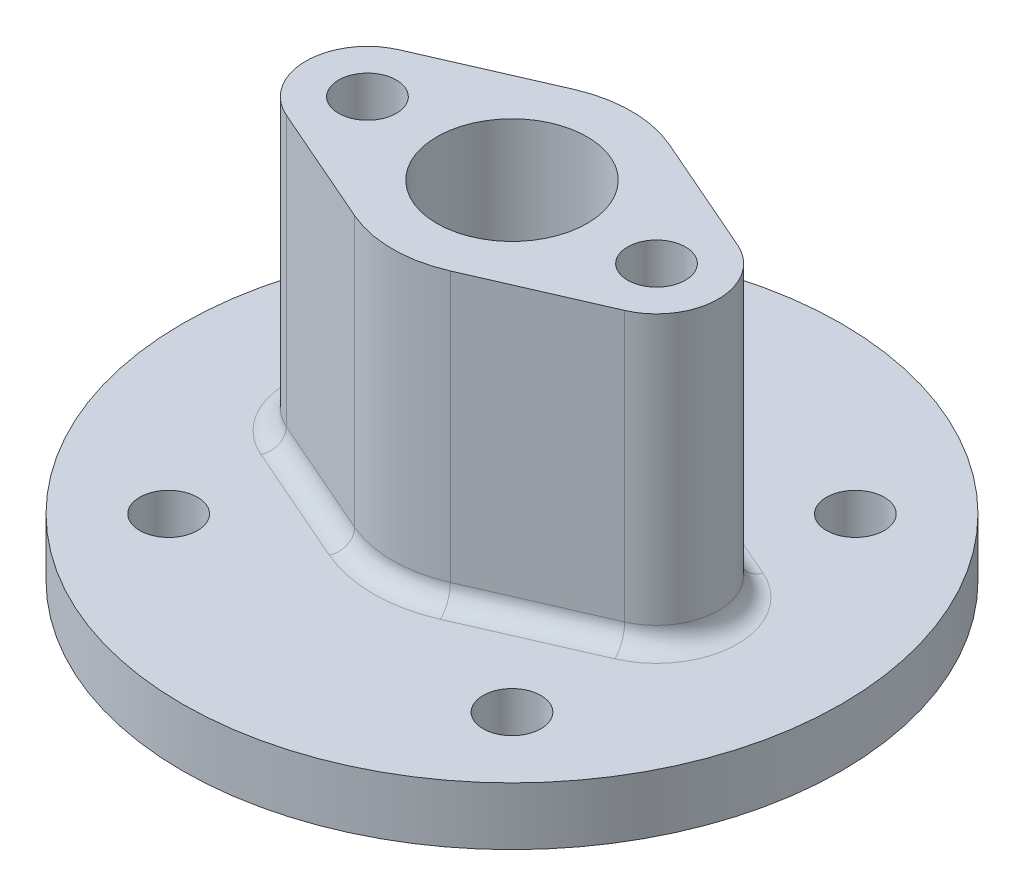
ISO-10303-21;
HEADER;
FILE_DESCRIPTION(('STEP AP214'),'2;1');
FILE_NAME('part.step','',(''),(''),'','','');
FILE_SCHEMA(('AUTOMOTIVE_DESIGN { 1 0 10303 214 1 1 1 1 }'));
ENDSEC;
DATA;
#1=APPLICATION_CONTEXT('core data for automotive mechanical design processes');
#2=APPLICATION_PROTOCOL_DEFINITION('international standard','automotive_design',2000,#1);
#3=PRODUCT_CONTEXT('',#1,'mechanical');
#4=PRODUCT('Part','Part','',(#3));
#5=PRODUCT_RELATED_PRODUCT_CATEGORY('part','',(#4));
#6=PRODUCT_DEFINITION_FORMATION('','',#4);
#7=PRODUCT_DEFINITION_CONTEXT('part definition',#1,'design');
#8=PRODUCT_DEFINITION('design','',#6,#7);
#9=PRODUCT_DEFINITION_SHAPE('','',#8);
#10=(LENGTH_UNIT() NAMED_UNIT(*) SI_UNIT(.MILLI.,.METRE.));
#11=(NAMED_UNIT(*) PLANE_ANGLE_UNIT() SI_UNIT($,.RADIAN.));
#12=(NAMED_UNIT(*) SI_UNIT($,.STERADIAN.) SOLID_ANGLE_UNIT());
#13=UNCERTAINTY_MEASURE_WITH_UNIT(LENGTH_MEASURE(1.E-05),#10,'distance_accuracy_value','');
#14=(GEOMETRIC_REPRESENTATION_CONTEXT(3) GLOBAL_UNCERTAINTY_ASSIGNED_CONTEXT((#13)) GLOBAL_UNIT_ASSIGNED_CONTEXT((#10,
#11,#12)) REPRESENTATION_CONTEXT('',''));
#15=CARTESIAN_POINT('',(0.,0.,0.));
#16=DIRECTION('',(0.,0.,1.));
#17=DIRECTION('',(1.,0.,0.));
#18=AXIS2_PLACEMENT_3D('',#15,#16,#17);
#19=CARTESIAN_POINT('',(0.,0.,0.));
#20=DIRECTION('',(0.,-1.,0.));
#21=DIRECTION('',(0.,0.,-1.));
#22=AXIS2_PLACEMENT_3D('',#19,#20,#21);
#23=PLANE('',#22);
#24=CARTESIAN_POINT('',(0.,0.,0.));
#25=DIRECTION('',(0.,-1.,0.));
#26=DIRECTION('',(0.,0.,-1.));
#27=AXIS2_PLACEMENT_3D('',#24,#25,#26);
#28=CIRCLE('',#27,24.);
#29=CARTESIAN_POINT('',(0.,0.,-24.));
#30=VERTEX_POINT('',#29);
#31=EDGE_CURVE('E224',#30,#30,#28,.T.);
#32=ORIENTED_EDGE('',*,*,#31,.T.);
#33=EDGE_LOOP('',(#32));
#34=FACE_BOUND('',#33,.T.);
#35=CARTESIAN_POINT('',(0.,0.,0.));
#36=DIRECTION('',(0.,1.,0.));
#37=DIRECTION('',(0.,0.,1.));
#38=AXIS2_PLACEMENT_3D('',#35,#36,#37);
#39=CIRCLE('',#38,10.5);
#40=CARTESIAN_POINT('',(0.,0.,10.5));
#41=VERTEX_POINT('',#40);
#42=EDGE_CURVE('E152',#41,#41,#39,.T.);
#43=ORIENTED_EDGE('',*,*,#42,.T.);
#44=EDGE_LOOP('',(#43));
#45=FACE_BOUND('',#44,.T.);
#46=ADVANCED_FACE('F33',(#34,#45),#23,.T.);
#47=CARTESIAN_POINT('',(-37.5,132.,0.));
#48=DIRECTION('',(0.,1.,0.));
#49=DIRECTION('',(0.,0.,1.));
#50=AXIS2_PLACEMENT_3D('',#47,#48,#49);
#51=PLANE('',#50);
#52=CARTESIAN_POINT('',(-37.5,132.,0.));
#53=DIRECTION('',(0.,1.,0.));
#54=DIRECTION('',(0.,0.,1.));
#55=AXIS2_PLACEMENT_3D('',#52,#53,#54);
#56=CIRCLE('',#55,7.5);
#57=CARTESIAN_POINT('',(-37.5,132.,7.5));
#58=VERTEX_POINT('',#57);
#59=EDGE_CURVE('E139',#58,#58,#56,.T.);
#60=ORIENTED_EDGE('',*,*,#59,.F.);
#61=EDGE_LOOP('',(#60));
#62=FACE_BOUND('',#61,.T.);
#63=CARTESIAN_POINT('',(37.5,132.,0.));
#64=DIRECTION('',(0.,1.,0.));
#65=DIRECTION('',(0.,0.,1.));
#66=AXIS2_PLACEMENT_3D('',#63,#64,#65);
#67=CIRCLE('',#66,7.5);
#68=CARTESIAN_POINT('',(37.5,132.,7.5));
#69=VERTEX_POINT('',#68);
#70=EDGE_CURVE('E138',#69,#69,#67,.T.);
#71=ORIENTED_EDGE('',*,*,#70,.F.);
#72=EDGE_LOOP('',(#71));
#73=FACE_BOUND('',#72,.T.);
#74=CARTESIAN_POINT('',(-37.5,132.,0.));
#75=DIRECTION('',(0.,1.,0.));
#76=DIRECTION('',(0.,0.,1.));
#77=AXIS2_PLACEMENT_3D('',#74,#75,#76);
#78=CIRCLE('',#77,16.);
#79=CARTESIAN_POINT('',(-43.9,132.,-14.6642422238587));
#80=VERTEX_POINT('',#79);
#81=CARTESIAN_POINT('',(-43.9,132.,14.6642422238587));
#82=VERTEX_POINT('',#81);
#83=EDGE_CURVE('E177',#80,#82,#78,.T.);
#84=ORIENTED_EDGE('',*,*,#83,.T.);
#85=DIRECTION('',(0.916515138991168,0.,0.4));
#86=VECTOR('',#85,1.);
#87=CARTESIAN_POINT('',(-43.9,132.,14.6642422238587));
#88=LINE('',#87,#86);
#89=CARTESIAN_POINT('',(-12.4,132.,28.4119693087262));
#90=VERTEX_POINT('',#89);
#91=EDGE_CURVE('E180',#82,#90,#88,.T.);
#92=ORIENTED_EDGE('',*,*,#91,.T.);
#93=CARTESIAN_POINT('',(0.,132.,0.));
#94=DIRECTION('',(0.,1.,0.));
#95=DIRECTION('',(0.,0.,1.));
#96=AXIS2_PLACEMENT_3D('',#93,#94,#95);
#97=CIRCLE('',#96,31.);
#98=CARTESIAN_POINT('',(12.4,132.,28.4119693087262));
#99=VERTEX_POINT('',#98);
#100=EDGE_CURVE('E182',#90,#99,#97,.T.);
#101=ORIENTED_EDGE('',*,*,#100,.T.);
#102=DIRECTION('',(0.916515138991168,0.,-0.4));
#103=VECTOR('',#102,1.);
#104=CARTESIAN_POINT('',(43.9,132.,14.6642422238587));
#105=LINE('',#104,#103);
#106=CARTESIAN_POINT('',(43.9,132.,14.6642422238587));
#107=VERTEX_POINT('',#106);
#108=EDGE_CURVE('E184',#99,#107,#105,.T.);
#109=ORIENTED_EDGE('',*,*,#108,.T.);
#110=CARTESIAN_POINT('',(37.5,132.,0.));
#111=DIRECTION('',(0.,1.,0.));
#112=DIRECTION('',(0.,0.,1.));
#113=AXIS2_PLACEMENT_3D('',#110,#111,#112);
#114=CIRCLE('',#113,16.);
#115=CARTESIAN_POINT('',(43.9,132.,-14.6642422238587));
#116=VERTEX_POINT('',#115);
#117=EDGE_CURVE('E186',#107,#116,#114,.T.);
#118=ORIENTED_EDGE('',*,*,#117,.T.);
#119=DIRECTION('',(-0.916515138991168,0.,-0.4));
#120=VECTOR('',#119,1.);
#121=CARTESIAN_POINT('',(43.9,132.,-14.6642422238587));
#122=LINE('',#121,#120);
#123=CARTESIAN_POINT('',(12.4,132.,-28.4119693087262));
#124=VERTEX_POINT('',#123);
#125=EDGE_CURVE('E188',#116,#124,#122,.T.);
#126=ORIENTED_EDGE('',*,*,#125,.T.);
#127=CARTESIAN_POINT('',(0.,132.,0.));
#128=DIRECTION('',(0.,1.,0.));
#129=DIRECTION('',(0.,0.,1.));
#130=AXIS2_PLACEMENT_3D('',#127,#128,#129);
#131=CIRCLE('',#130,31.);
#132=CARTESIAN_POINT('',(-12.4,132.,-28.4119693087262));
#133=VERTEX_POINT('',#132);
#134=EDGE_CURVE('E190',#124,#133,#131,.T.);
#135=ORIENTED_EDGE('',*,*,#134,.T.);
#136=DIRECTION('',(-0.916515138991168,0.,0.4));
#137=VECTOR('',#136,1.);
#138=CARTESIAN_POINT('',(-43.9,132.,-14.6642422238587));
#139=LINE('',#138,#137);
#140=EDGE_CURVE('E192',#133,#80,#139,.T.);
#141=ORIENTED_EDGE('',*,*,#140,.T.);
#142=EDGE_LOOP('',(#84,#92,#101,#109,#118,#126,#135,#141));
#143=FACE_BOUND('',#142,.T.);
#144=CARTESIAN_POINT('',(0.,132.,0.));
#145=DIRECTION('',(0.,1.,0.));
#146=DIRECTION('',(0.,0.,1.));
#147=AXIS2_PLACEMENT_3D('',#144,#145,#146);
#148=CIRCLE('',#147,19.5);
#149=CARTESIAN_POINT('',(0.,132.,19.5));
#150=VERTEX_POINT('',#149);
#151=EDGE_CURVE('E174',#150,#150,#148,.T.);
#152=ORIENTED_EDGE('',*,*,#151,.F.);
#153=EDGE_LOOP('',(#152));
#154=FACE_BOUND('',#153,.T.);
#155=ADVANCED_FACE('F307',(#62,#73,#143,#154),#51,.T.);
#156=CARTESIAN_POINT('',(85.5,57.,0.));
#157=DIRECTION('',(0.,1.,0.));
#158=DIRECTION('',(0.,0.,1.));
#159=AXIS2_PLACEMENT_3D('',#156,#157,#158);
#160=PLANE('',#159);
#161=CARTESIAN_POINT('',(-44.5477272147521,57.,-44.5477272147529));
#162=DIRECTION('',(0.,1.,0.));
#163=DIRECTION('',(1.,0.,0.));
#164=AXIS2_PLACEMENT_3D('',#161,#162,#163);
#165=CIRCLE('',#164,7.5);
#166=CARTESIAN_POINT('',(-37.0477272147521,57.,-44.5477272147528));
#167=VERTEX_POINT('',#166);
#168=EDGE_CURVE('E296',#167,#167,#165,.T.);
#169=ORIENTED_EDGE('',*,*,#168,.F.);
#170=EDGE_LOOP('',(#169));
#171=FACE_BOUND('',#170,.T.);
#172=CARTESIAN_POINT('',(-44.5477272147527,57.,44.5477272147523));
#173=DIRECTION('',(0.,1.,0.));
#174=DIRECTION('',(0.,0.,-1.));
#175=AXIS2_PLACEMENT_3D('',#172,#173,#174);
#176=CIRCLE('',#175,7.5);
#177=CARTESIAN_POINT('',(-44.5477272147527,57.,37.0477272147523));
#178=VERTEX_POINT('',#177);
#179=EDGE_CURVE('E286',#178,#178,#176,.T.);
#180=ORIENTED_EDGE('',*,*,#179,.F.);
#181=EDGE_LOOP('',(#180));
#182=FACE_BOUND('',#181,.T.);
#183=CARTESIAN_POINT('',(44.5477272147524,57.,44.5477272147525));
#184=DIRECTION('',(0.,1.,0.));
#185=DIRECTION('',(-1.,0.,0.));
#186=AXIS2_PLACEMENT_3D('',#183,#184,#185);
#187=CIRCLE('',#186,7.5);
#188=CARTESIAN_POINT('',(37.0477272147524,57.,44.5477272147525));
#189=VERTEX_POINT('',#188);
#190=EDGE_CURVE('E283',#189,#189,#187,.T.);
#191=ORIENTED_EDGE('',*,*,#190,.F.);
#192=EDGE_LOOP('',(#191));
#193=FACE_BOUND('',#192,.T.);
#194=CARTESIAN_POINT('',(44.5477272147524,57.,-44.5477272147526));
#195=DIRECTION('',(0.,1.,0.));
#196=DIRECTION('',(0.,0.,1.));
#197=AXIS2_PLACEMENT_3D('',#194,#195,#196);
#198=CIRCLE('',#197,7.5);
#199=CARTESIAN_POINT('',(44.5477272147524,57.,-37.0477272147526));
#200=VERTEX_POINT('',#199);
#201=EDGE_CURVE('E280',#200,#200,#198,.T.);
#202=ORIENTED_EDGE('',*,*,#201,.F.);
#203=EDGE_LOOP('',(#202));
#204=FACE_BOUND('',#203,.T.);
#205=DIRECTION('',(0.916515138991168,0.,-0.4));
#206=VECTOR('',#205,1.);
#207=CARTESIAN_POINT('',(86.22,57.,1.6497272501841));
#208=LINE('',#207,#206);
#209=CARTESIAN_POINT('',(45.9,57.,19.2468179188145));
#210=VERTEX_POINT('',#209);
#211=CARTESIAN_POINT('',(14.4,57.,32.9945450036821));
#212=VERTEX_POINT('',#211);
#213=EDGE_CURVE('E230',#210,#212,#208,.F.);
#214=ORIENTED_EDGE('',*,*,#213,.T.);
#215=CARTESIAN_POINT('',(0.,57.,0.));
#216=DIRECTION('',(0.,1.,0.));
#217=DIRECTION('',(0.,0.,1.));
#218=AXIS2_PLACEMENT_3D('',#215,#216,#217);
#219=CIRCLE('',#218,36.);
#220=CARTESIAN_POINT('',(-14.4,57.,32.994545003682));
#221=VERTEX_POINT('',#220);
#222=EDGE_CURVE('E244',#212,#221,#219,.F.);
#223=ORIENTED_EDGE('',*,*,#222,.T.);
#224=DIRECTION('',(0.916515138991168,0.,0.4));
#225=VECTOR('',#224,1.);
#226=CARTESIAN_POINT('',(57.42,57.,64.33936275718));
#227=LINE('',#226,#225);
#228=CARTESIAN_POINT('',(-45.9,57.,19.2468179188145));
#229=VERTEX_POINT('',#228);
#230=EDGE_CURVE('E242',#221,#229,#227,.F.);
#231=ORIENTED_EDGE('',*,*,#230,.T.);
#232=CARTESIAN_POINT('',(-37.5,57.,0.));
#233=DIRECTION('',(0.,1.,0.));
#234=DIRECTION('',(0.,0.,1.));
#235=AXIS2_PLACEMENT_3D('',#232,#233,#234);
#236=CIRCLE('',#235,21.);
#237=CARTESIAN_POINT('',(-45.9,57.,-19.2468179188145));
#238=VERTEX_POINT('',#237);
#239=EDGE_CURVE('E240',#229,#238,#236,.F.);
#240=ORIENTED_EDGE('',*,*,#239,.T.);
#241=DIRECTION('',(-0.916515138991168,0.,0.4));
#242=VECTOR('',#241,1.);
#243=CARTESIAN_POINT('',(57.42,57.,-64.33936275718));
#244=LINE('',#243,#242);
#245=CARTESIAN_POINT('',(-14.4,57.,-32.9945450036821));
#246=VERTEX_POINT('',#245);
#247=EDGE_CURVE('E238',#238,#246,#244,.F.);
#248=ORIENTED_EDGE('',*,*,#247,.T.);
#249=CARTESIAN_POINT('',(0.,57.,0.));
#250=DIRECTION('',(0.,1.,0.));
#251=DIRECTION('',(0.,0.,1.));
#252=AXIS2_PLACEMENT_3D('',#249,#250,#251);
#253=CIRCLE('',#252,36.);
#254=CARTESIAN_POINT('',(14.4,57.,-32.994545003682));
#255=VERTEX_POINT('',#254);
#256=EDGE_CURVE('E236',#246,#255,#253,.F.);
#257=ORIENTED_EDGE('',*,*,#256,.T.);
#258=DIRECTION('',(-0.916515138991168,0.,-0.4));
#259=VECTOR('',#258,1.);
#260=CARTESIAN_POINT('',(86.22,57.,-1.64972725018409));
#261=LINE('',#260,#259);
#262=CARTESIAN_POINT('',(45.9,57.,-19.2468179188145));
#263=VERTEX_POINT('',#262);
#264=EDGE_CURVE('E234',#255,#263,#261,.F.);
#265=ORIENTED_EDGE('',*,*,#264,.T.);
#266=CARTESIAN_POINT('',(37.5,57.,0.));
#267=DIRECTION('',(0.,1.,0.));
#268=DIRECTION('',(0.,0.,1.));
#269=AXIS2_PLACEMENT_3D('',#266,#267,#268);
#270=CIRCLE('',#269,21.);
#271=EDGE_CURVE('E232',#263,#210,#270,.F.);
#272=ORIENTED_EDGE('',*,*,#271,.T.);
#273=EDGE_LOOP('',(#214,#223,#231,#240,#248,#257,#265,#272));
#274=FACE_BOUND('',#273,.T.);
#275=CARTESIAN_POINT('',(0.,57.,0.));
#276=DIRECTION('',(0.,-1.,0.));
#277=DIRECTION('',(0.,0.,-1.));
#278=AXIS2_PLACEMENT_3D('',#275,#276,#277);
#279=CIRCLE('',#278,85.5);
#280=CARTESIAN_POINT('',(0.,57.,-85.5));
#281=VERTEX_POINT('',#280);
#282=EDGE_CURVE('E215',#281,#281,#279,.T.);
#283=ORIENTED_EDGE('',*,*,#282,.F.);
#284=EDGE_LOOP('',(#283));
#285=FACE_BOUND('',#284,.T.);
#286=ADVANCED_FACE('F303',(#171,#182,#193,#204,#274,#285),#160,.T.);
#287=CARTESIAN_POINT('',(0.,0.,0.));
#288=DIRECTION('',(0.,1.,0.));
#289=DIRECTION('',(0.,0.,1.));
#290=AXIS2_PLACEMENT_3D('',#287,#288,#289);
#291=CONICAL_SURFACE('',#290,24.,0.404891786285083);
#292=CARTESIAN_POINT('',(0.,42.,0.));
#293=DIRECTION('',(0.,-1.,0.));
#294=DIRECTION('',(0.,0.,-1.));
#295=AXIS2_PLACEMENT_3D('',#292,#293,#294);
#296=CIRCLE('',#295,42.);
#297=CARTESIAN_POINT('',(0.,42.,-42.));
#298=VERTEX_POINT('',#297);
#299=EDGE_CURVE('E221',#298,#298,#296,.T.);
#300=ORIENTED_EDGE('',*,*,#299,.T.);
#301=EDGE_LOOP('',(#300));
#302=FACE_BOUND('',#301,.T.);
#303=ORIENTED_EDGE('',*,*,#31,.F.);
#304=EDGE_LOOP('',(#303));
#305=FACE_BOUND('',#304,.T.);
#306=ADVANCED_FACE('F306',(#302,#305),#291,.T.);
#307=CARTESIAN_POINT('',(42.,42.,0.));
#308=DIRECTION('',(0.,-1.,0.));
#309=DIRECTION('',(0.,0.,-1.));
#310=AXIS2_PLACEMENT_3D('',#307,#308,#309);
#311=PLANE('',#310);
#312=CARTESIAN_POINT('',(-44.5477272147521,42.,-44.5477272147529));
#313=DIRECTION('',(0.,-1.,0.));
#314=DIRECTION('',(0.,0.,-1.));
#315=AXIS2_PLACEMENT_3D('',#312,#313,#314);
#316=CIRCLE('',#315,7.5);
#317=CARTESIAN_POINT('',(-44.5477272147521,42.,-52.0477272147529));
#318=VERTEX_POINT('',#317);
#319=EDGE_CURVE('E37',#318,#318,#316,.T.);
#320=ORIENTED_EDGE('',*,*,#319,.F.);
#321=EDGE_LOOP('',(#320));
#322=FACE_BOUND('',#321,.T.);
#323=CARTESIAN_POINT('',(-44.5477272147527,42.,44.5477272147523));
#324=DIRECTION('',(0.,-1.,0.));
#325=DIRECTION('',(0.,0.,-1.));
#326=AXIS2_PLACEMENT_3D('',#323,#324,#325);
#327=CIRCLE('',#326,7.5);
#328=CARTESIAN_POINT('',(-44.5477272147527,42.,37.0477272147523));
#329=VERTEX_POINT('',#328);
#330=EDGE_CURVE('E284',#329,#329,#327,.T.);
#331=ORIENTED_EDGE('',*,*,#330,.F.);
#332=EDGE_LOOP('',(#331));
#333=FACE_BOUND('',#332,.T.);
#334=CARTESIAN_POINT('',(44.5477272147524,42.,44.5477272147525));
#335=DIRECTION('',(0.,-1.,0.));
#336=DIRECTION('',(0.,0.,-1.));
#337=AXIS2_PLACEMENT_3D('',#334,#335,#336);
#338=CIRCLE('',#337,7.5);
#339=CARTESIAN_POINT('',(44.5477272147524,42.,37.0477272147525));
#340=VERTEX_POINT('',#339);
#341=EDGE_CURVE('E281',#340,#340,#338,.T.);
#342=ORIENTED_EDGE('',*,*,#341,.F.);
#343=EDGE_LOOP('',(#342));
#344=FACE_BOUND('',#343,.T.);
#345=CARTESIAN_POINT('',(44.5477272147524,42.,-44.5477272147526));
#346=DIRECTION('',(0.,-1.,0.));
#347=DIRECTION('',(0.,0.,-1.));
#348=AXIS2_PLACEMENT_3D('',#345,#346,#347);
#349=CIRCLE('',#348,7.5);
#350=CARTESIAN_POINT('',(44.5477272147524,42.,-52.0477272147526));
#351=VERTEX_POINT('',#350);
#352=EDGE_CURVE('E145',#351,#351,#349,.T.);
#353=ORIENTED_EDGE('',*,*,#352,.F.);
#354=EDGE_LOOP('',(#353));
#355=FACE_BOUND('',#354,.T.);
#356=CARTESIAN_POINT('',(0.,42.,0.));
#357=DIRECTION('',(0.,-1.,0.));
#358=DIRECTION('',(0.,0.,-1.));
#359=AXIS2_PLACEMENT_3D('',#356,#357,#358);
#360=CIRCLE('',#359,85.5);
#361=CARTESIAN_POINT('',(0.,42.,-85.5));
#362=VERTEX_POINT('',#361);
#363=EDGE_CURVE('E218',#362,#362,#360,.T.);
#364=ORIENTED_EDGE('',*,*,#363,.T.);
#365=EDGE_LOOP('',(#364));
#366=FACE_BOUND('',#365,.T.);
#367=ORIENTED_EDGE('',*,*,#299,.F.);
#368=EDGE_LOOP('',(#367));
#369=FACE_BOUND('',#368,.T.);
#370=ADVANCED_FACE('F319',(#322,#333,#344,#355,#366,#369),#311,.T.);
#371=CARTESIAN_POINT('',(0.,0.,0.));
#372=DIRECTION('',(0.,-1.,0.));
#373=DIRECTION('',(0.,0.,-1.));
#374=AXIS2_PLACEMENT_3D('',#371,#372,#373);
#375=CYLINDRICAL_SURFACE('',#374,85.5);
#376=ORIENTED_EDGE('',*,*,#282,.T.);
#377=EDGE_LOOP('',(#376));
#378=FACE_BOUND('',#377,.T.);
#379=ORIENTED_EDGE('',*,*,#363,.F.);
#380=EDGE_LOOP('',(#379));
#381=FACE_BOUND('',#380,.T.);
#382=ADVANCED_FACE('F315',(#378,#381),#375,.T.);
#383=CARTESIAN_POINT('',(-37.5,132.,0.));
#384=DIRECTION('',(0.,-1.,0.));
#385=DIRECTION('',(0.,0.,-1.));
#386=AXIS2_PLACEMENT_3D('',#383,#384,#385);
#387=CYLINDRICAL_SURFACE('',#386,16.);
#388=DIRECTION('',(0.,-1.,0.));
#389=VECTOR('',#388,1.);
#390=CARTESIAN_POINT('',(-43.9,132.,-14.6642422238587));
#391=LINE('',#390,#389);
#392=CARTESIAN_POINT('',(-43.9,62.,-14.6642422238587));
#393=VERTEX_POINT('',#392);
#394=EDGE_CURVE('E194',#80,#393,#391,.T.);
#395=ORIENTED_EDGE('',*,*,#394,.T.);
#396=CARTESIAN_POINT('',(-37.5,62.,0.));
#397=DIRECTION('',(0.,1.,0.));
#398=DIRECTION('',(0.,0.,1.));
#399=AXIS2_PLACEMENT_3D('',#396,#397,#398);
#400=CIRCLE('',#399,16.);
#401=CARTESIAN_POINT('',(-43.9,62.,14.6642422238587));
#402=VERTEX_POINT('',#401);
#403=EDGE_CURVE('E249',#393,#402,#400,.T.);
#404=ORIENTED_EDGE('',*,*,#403,.T.);
#405=DIRECTION('',(0.,-1.,0.));
#406=VECTOR('',#405,1.);
#407=CARTESIAN_POINT('',(-43.9,132.,14.6642422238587));
#408=LINE('',#407,#406);
#409=EDGE_CURVE('E212',#82,#402,#408,.T.);
#410=ORIENTED_EDGE('',*,*,#409,.F.);
#411=ORIENTED_EDGE('',*,*,#83,.F.);
#412=EDGE_LOOP('',(#395,#404,#410,#411));
#413=FACE_BOUND('',#412,.T.);
#414=ADVANCED_FACE('F318',(#413),#387,.T.);
#415=CARTESIAN_POINT('',(-43.9,132.,14.6642422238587));
#416=DIRECTION('',(0.4,0.,-0.916515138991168));
#417=DIRECTION('',(-0.916515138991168,0.,-0.4));
#418=AXIS2_PLACEMENT_3D('',#415,#416,#417);
#419=PLANE('',#418);
#420=ORIENTED_EDGE('',*,*,#409,.T.);
#421=DIRECTION('',(0.916515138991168,0.,0.4));
#422=VECTOR('',#421,1.);
#423=CARTESIAN_POINT('',(-43.9,62.,14.6642422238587));
#424=LINE('',#423,#422);
#425=CARTESIAN_POINT('',(-12.4,62.,28.4119693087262));
#426=VERTEX_POINT('',#425);
#427=EDGE_CURVE('E247',#402,#426,#424,.T.);
#428=ORIENTED_EDGE('',*,*,#427,.T.);
#429=DIRECTION('',(0.,-1.,0.));
#430=VECTOR('',#429,1.);
#431=CARTESIAN_POINT('',(-12.4,132.,28.4119693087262));
#432=LINE('',#431,#430);
#433=EDGE_CURVE('E209',#90,#426,#432,.T.);
#434=ORIENTED_EDGE('',*,*,#433,.F.);
#435=ORIENTED_EDGE('',*,*,#91,.F.);
#436=EDGE_LOOP('',(#420,#428,#434,#435));
#437=FACE_BOUND('',#436,.T.);
#438=ADVANCED_FACE('F400',(#437),#419,.F.);
#439=CARTESIAN_POINT('',(0.,132.,0.));
#440=DIRECTION('',(0.,-1.,0.));
#441=DIRECTION('',(0.,0.,-1.));
#442=AXIS2_PLACEMENT_3D('',#439,#440,#441);
#443=CYLINDRICAL_SURFACE('',#442,31.);
#444=ORIENTED_EDGE('',*,*,#433,.T.);
#445=CARTESIAN_POINT('',(0.,62.,0.));
#446=DIRECTION('',(0.,1.,0.));
#447=DIRECTION('',(0.,0.,1.));
#448=AXIS2_PLACEMENT_3D('',#445,#446,#447);
#449=CIRCLE('',#448,31.);
#450=CARTESIAN_POINT('',(12.4,62.,28.4119693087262));
#451=VERTEX_POINT('',#450);
#452=EDGE_CURVE('E227',#426,#451,#449,.T.);
#453=ORIENTED_EDGE('',*,*,#452,.T.);
#454=DIRECTION('',(0.,-1.,0.));
#455=VECTOR('',#454,1.);
#456=CARTESIAN_POINT('',(12.4,132.,28.4119693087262));
#457=LINE('',#456,#455);
#458=EDGE_CURVE('E207',#99,#451,#457,.T.);
#459=ORIENTED_EDGE('',*,*,#458,.F.);
#460=ORIENTED_EDGE('',*,*,#100,.F.);
#461=EDGE_LOOP('',(#444,#453,#459,#460));
#462=FACE_BOUND('',#461,.T.);
#463=ADVANCED_FACE('F397',(#462),#443,.T.);
#464=CARTESIAN_POINT('',(43.9,132.,14.6642422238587));
#465=DIRECTION('',(-0.4,0.,-0.916515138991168));
#466=DIRECTION('',(-0.916515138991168,0.,0.4));
#467=AXIS2_PLACEMENT_3D('',#464,#465,#466);
#468=PLANE('',#467);
#469=ORIENTED_EDGE('',*,*,#458,.T.);
#470=DIRECTION('',(0.916515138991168,0.,-0.4));
#471=VECTOR('',#470,1.);
#472=CARTESIAN_POINT('',(43.9,62.,14.6642422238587));
#473=LINE('',#472,#471);
#474=CARTESIAN_POINT('',(43.9,62.,14.6642422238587));
#475=VERTEX_POINT('',#474);
#476=EDGE_CURVE('E12',#451,#475,#473,.T.);
#477=ORIENTED_EDGE('',*,*,#476,.T.);
#478=DIRECTION('',(0.,-1.,0.));
#479=VECTOR('',#478,1.);
#480=CARTESIAN_POINT('',(43.9,132.,14.6642422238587));
#481=LINE('',#480,#479);
#482=EDGE_CURVE('E205',#107,#475,#481,.T.);
#483=ORIENTED_EDGE('',*,*,#482,.F.);
#484=ORIENTED_EDGE('',*,*,#108,.F.);
#485=EDGE_LOOP('',(#469,#477,#483,#484));
#486=FACE_BOUND('',#485,.T.);
#487=ADVANCED_FACE('F394',(#486),#468,.F.);
#488=CARTESIAN_POINT('',(37.5,132.,0.));
#489=DIRECTION('',(0.,-1.,0.));
#490=DIRECTION('',(0.,0.,-1.));
#491=AXIS2_PLACEMENT_3D('',#488,#489,#490);
#492=CYLINDRICAL_SURFACE('',#491,16.);
#493=ORIENTED_EDGE('',*,*,#482,.T.);
#494=CARTESIAN_POINT('',(37.5,62.,0.));
#495=DIRECTION('',(0.,1.,0.));
#496=DIRECTION('',(0.,0.,1.));
#497=AXIS2_PLACEMENT_3D('',#494,#495,#496);
#498=CIRCLE('',#497,16.);
#499=CARTESIAN_POINT('',(43.9,62.,-14.6642422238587));
#500=VERTEX_POINT('',#499);
#501=EDGE_CURVE('E42',#475,#500,#498,.T.);
#502=ORIENTED_EDGE('',*,*,#501,.T.);
#503=DIRECTION('',(0.,-1.,0.));
#504=VECTOR('',#503,1.);
#505=CARTESIAN_POINT('',(43.9,132.,-14.6642422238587));
#506=LINE('',#505,#504);
#507=EDGE_CURVE('E203',#116,#500,#506,.T.);
#508=ORIENTED_EDGE('',*,*,#507,.F.);
#509=ORIENTED_EDGE('',*,*,#117,.F.);
#510=EDGE_LOOP('',(#493,#502,#508,#509));
#511=FACE_BOUND('',#510,.T.);
#512=ADVANCED_FACE('F390',(#511),#492,.T.);
#513=CARTESIAN_POINT('',(43.9,132.,-14.6642422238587));
#514=DIRECTION('',(-0.4,0.,0.916515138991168));
#515=DIRECTION('',(0.916515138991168,0.,0.4));
#516=AXIS2_PLACEMENT_3D('',#513,#514,#515);
#517=PLANE('',#516);
#518=ORIENTED_EDGE('',*,*,#507,.T.);
#519=DIRECTION('',(-0.916515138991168,0.,-0.4));
#520=VECTOR('',#519,1.);
#521=CARTESIAN_POINT('',(43.9,62.,-14.6642422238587));
#522=LINE('',#521,#520);
#523=CARTESIAN_POINT('',(12.4,62.,-28.4119693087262));
#524=VERTEX_POINT('',#523);
#525=EDGE_CURVE('E255',#500,#524,#522,.T.);
#526=ORIENTED_EDGE('',*,*,#525,.T.);
#527=DIRECTION('',(0.,-1.,0.));
#528=VECTOR('',#527,1.);
#529=CARTESIAN_POINT('',(12.4,132.,-28.4119693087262));
#530=LINE('',#529,#528);
#531=EDGE_CURVE('E200',#124,#524,#530,.T.);
#532=ORIENTED_EDGE('',*,*,#531,.F.);
#533=ORIENTED_EDGE('',*,*,#125,.F.);
#534=EDGE_LOOP('',(#518,#526,#532,#533));
#535=FACE_BOUND('',#534,.T.);
#536=ADVANCED_FACE('F386',(#535),#517,.F.);
#537=CARTESIAN_POINT('',(0.,132.,0.));
#538=DIRECTION('',(0.,-1.,0.));
#539=DIRECTION('',(0.,0.,-1.));
#540=AXIS2_PLACEMENT_3D('',#537,#538,#539);
#541=CYLINDRICAL_SURFACE('',#540,31.);
#542=ORIENTED_EDGE('',*,*,#531,.T.);
#543=CARTESIAN_POINT('',(0.,62.,0.));
#544=DIRECTION('',(0.,1.,0.));
#545=DIRECTION('',(0.,0.,1.));
#546=AXIS2_PLACEMENT_3D('',#543,#544,#545);
#547=CIRCLE('',#546,31.);
#548=CARTESIAN_POINT('',(-12.4,62.,-28.4119693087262));
#549=VERTEX_POINT('',#548);
#550=EDGE_CURVE('E253',#524,#549,#547,.T.);
#551=ORIENTED_EDGE('',*,*,#550,.T.);
#552=DIRECTION('',(0.,-1.,0.));
#553=VECTOR('',#552,1.);
#554=CARTESIAN_POINT('',(-12.4,132.,-28.4119693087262));
#555=LINE('',#554,#553);
#556=EDGE_CURVE('E197',#133,#549,#555,.T.);
#557=ORIENTED_EDGE('',*,*,#556,.F.);
#558=ORIENTED_EDGE('',*,*,#134,.F.);
#559=EDGE_LOOP('',(#542,#551,#557,#558));
#560=FACE_BOUND('',#559,.T.);
#561=ADVANCED_FACE('F382',(#560),#541,.T.);
#562=CARTESIAN_POINT('',(-43.9,132.,-14.6642422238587));
#563=DIRECTION('',(0.4,0.,0.916515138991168));
#564=DIRECTION('',(0.916515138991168,0.,-0.4));
#565=AXIS2_PLACEMENT_3D('',#562,#563,#564);
#566=PLANE('',#565);
#567=ORIENTED_EDGE('',*,*,#556,.T.);
#568=DIRECTION('',(-0.916515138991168,0.,0.4));
#569=VECTOR('',#568,1.);
#570=CARTESIAN_POINT('',(-43.9,62.,-14.6642422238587));
#571=LINE('',#570,#569);
#572=EDGE_CURVE('E251',#549,#393,#571,.T.);
#573=ORIENTED_EDGE('',*,*,#572,.T.);
#574=ORIENTED_EDGE('',*,*,#394,.F.);
#575=ORIENTED_EDGE('',*,*,#140,.F.);
#576=EDGE_LOOP('',(#567,#573,#574,#575));
#577=FACE_BOUND('',#576,.T.);
#578=ADVANCED_FACE('F375',(#577),#566,.F.);
#579=CARTESIAN_POINT('',(0.,148.009304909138,0.));
#580=DIRECTION('',(0.,1.,0.));
#581=DIRECTION('',(0.,0.,1.));
#582=AXIS2_PLACEMENT_3D('',#579,#580,#581);
#583=CYLINDRICAL_SURFACE('',#582,19.5);
#584=ORIENTED_EDGE('',*,*,#151,.T.);
#585=EDGE_LOOP('',(#584));
#586=FACE_BOUND('',#585,.T.);
#587=CARTESIAN_POINT('',(0.,102.,0.));
#588=DIRECTION('',(0.,1.,0.));
#589=DIRECTION('',(0.,0.,1.));
#590=AXIS2_PLACEMENT_3D('',#587,#588,#589);
#591=CIRCLE('',#590,19.5);
#592=CARTESIAN_POINT('',(0.,102.,19.5));
#593=VERTEX_POINT('',#592);
#594=EDGE_CURVE('E171',#593,#593,#591,.T.);
#595=ORIENTED_EDGE('',*,*,#594,.F.);
#596=EDGE_LOOP('',(#595));
#597=FACE_BOUND('',#596,.T.);
#598=ADVANCED_FACE('F371',(#586,#597),#583,.F.);
#599=CARTESIAN_POINT('',(0.,100.,0.));
#600=DIRECTION('',(0.,1.,0.));
#601=DIRECTION('',(0.,0.,1.));
#602=AXIS2_PLACEMENT_3D('',#599,#600,#601);
#603=CONICAL_SURFACE('',#602,10.5,1.35212738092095);
#604=ORIENTED_EDGE('',*,*,#594,.T.);
#605=EDGE_LOOP('',(#604));
#606=FACE_BOUND('',#605,.T.);
#607=CARTESIAN_POINT('',(0.,100.,0.));
#608=DIRECTION('',(0.,1.,0.));
#609=DIRECTION('',(0.,0.,1.));
#610=AXIS2_PLACEMENT_3D('',#607,#608,#609);
#611=CIRCLE('',#610,10.5);
#612=CARTESIAN_POINT('',(0.,100.,10.5));
#613=VERTEX_POINT('',#612);
#614=EDGE_CURVE('E168',#613,#613,#611,.T.);
#615=ORIENTED_EDGE('',*,*,#614,.F.);
#616=EDGE_LOOP('',(#615));
#617=FACE_BOUND('',#616,.T.);
#618=ADVANCED_FACE('F367',(#606,#617),#603,.F.);
#619=CARTESIAN_POINT('',(0.,148.009304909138,0.));
#620=DIRECTION('',(0.,1.,0.));
#621=DIRECTION('',(0.,0.,1.));
#622=AXIS2_PLACEMENT_3D('',#619,#620,#621);
#623=CYLINDRICAL_SURFACE('',#622,10.5);
#624=ORIENTED_EDGE('',*,*,#614,.T.);
#625=EDGE_LOOP('',(#624));
#626=FACE_BOUND('',#625,.T.);
#627=CARTESIAN_POINT('',(0.,90.,0.));
#628=DIRECTION('',(0.,1.,0.));
#629=DIRECTION('',(0.,0.,1.));
#630=AXIS2_PLACEMENT_3D('',#627,#628,#629);
#631=CIRCLE('',#630,10.5);
#632=CARTESIAN_POINT('',(0.,90.,10.5));
#633=VERTEX_POINT('',#632);
#634=EDGE_CURVE('E165',#633,#633,#631,.T.);
#635=ORIENTED_EDGE('',*,*,#634,.F.);
#636=EDGE_LOOP('',(#635));
#637=FACE_BOUND('',#636,.T.);
#638=ADVANCED_FACE('F363',(#626,#637),#623,.F.);
#639=CARTESIAN_POINT('',(10.5,90.,0.));
#640=DIRECTION('',(0.,-1.,0.));
#641=DIRECTION('',(0.,0.,-1.));
#642=AXIS2_PLACEMENT_3D('',#639,#640,#641);
#643=PLANE('',#642);
#644=ORIENTED_EDGE('',*,*,#634,.T.);
#645=EDGE_LOOP('',(#644));
#646=FACE_BOUND('',#645,.T.);
#647=CARTESIAN_POINT('',(0.,90.,0.));
#648=DIRECTION('',(0.,1.,0.));
#649=DIRECTION('',(0.,0.,1.));
#650=AXIS2_PLACEMENT_3D('',#647,#648,#649);
#651=CIRCLE('',#650,19.5);
#652=CARTESIAN_POINT('',(0.,90.,19.5));
#653=VERTEX_POINT('',#652);
#654=EDGE_CURVE('E162',#653,#653,#651,.T.);
#655=ORIENTED_EDGE('',*,*,#654,.F.);
#656=EDGE_LOOP('',(#655));
#657=FACE_BOUND('',#656,.T.);
#658=ADVANCED_FACE('F359',(#646,#657),#643,.T.);
#659=CARTESIAN_POINT('',(0.,148.009304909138,0.));
#660=DIRECTION('',(0.,1.,0.));
#661=DIRECTION('',(0.,0.,1.));
#662=AXIS2_PLACEMENT_3D('',#659,#660,#661);
#663=CYLINDRICAL_SURFACE('',#662,19.5);
#664=ORIENTED_EDGE('',*,*,#654,.T.);
#665=EDGE_LOOP('',(#664));
#666=FACE_BOUND('',#665,.T.);
#667=CARTESIAN_POINT('',(0.,66.,0.));
#668=DIRECTION('',(0.,1.,0.));
#669=DIRECTION('',(0.,0.,1.));
#670=AXIS2_PLACEMENT_3D('',#667,#668,#669);
#671=CIRCLE('',#670,19.5);
#672=CARTESIAN_POINT('',(0.,66.,19.5));
#673=VERTEX_POINT('',#672);
#674=EDGE_CURVE('E159',#673,#673,#671,.T.);
#675=ORIENTED_EDGE('',*,*,#674,.F.);
#676=EDGE_LOOP('',(#675));
#677=FACE_BOUND('',#676,.T.);
#678=ADVANCED_FACE('F350',(#666,#677),#663,.F.);
#679=CARTESIAN_POINT('',(19.5,66.,0.));
#680=DIRECTION('',(0.,1.,0.));
#681=DIRECTION('',(0.,0.,1.));
#682=AXIS2_PLACEMENT_3D('',#679,#680,#681);
#683=PLANE('',#682);
#684=ORIENTED_EDGE('',*,*,#674,.T.);
#685=EDGE_LOOP('',(#684));
#686=FACE_BOUND('',#685,.T.);
#687=CARTESIAN_POINT('',(0.,66.,0.));
#688=DIRECTION('',(0.,1.,0.));
#689=DIRECTION('',(0.,0.,1.));
#690=AXIS2_PLACEMENT_3D('',#687,#688,#689);
#691=CIRCLE('',#690,10.5);
#692=CARTESIAN_POINT('',(0.,66.,10.5));
#693=VERTEX_POINT('',#692);
#694=EDGE_CURVE('E155',#693,#693,#691,.T.);
#695=ORIENTED_EDGE('',*,*,#694,.F.);
#696=EDGE_LOOP('',(#695));
#697=FACE_BOUND('',#696,.T.);
#698=ADVANCED_FACE('F341',(#686,#697),#683,.T.);
#699=CARTESIAN_POINT('',(0.,148.009304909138,0.));
#700=DIRECTION('',(0.,1.,0.));
#701=DIRECTION('',(0.,0.,1.));
#702=AXIS2_PLACEMENT_3D('',#699,#700,#701);
#703=CYLINDRICAL_SURFACE('',#702,10.5);
#704=ORIENTED_EDGE('',*,*,#694,.T.);
#705=EDGE_LOOP('',(#704));
#706=FACE_BOUND('',#705,.T.);
#707=ORIENTED_EDGE('',*,*,#42,.F.);
#708=EDGE_LOOP('',(#707));
#709=FACE_BOUND('',#708,.T.);
#710=ADVANCED_FACE('F339',(#706,#709),#703,.F.);
#711=CARTESIAN_POINT('',(0.,62.,0.));
#712=DIRECTION('',(0.,1.,0.));
#713=DIRECTION('',(0.,0.,1.));
#714=AXIS2_PLACEMENT_3D('',#711,#712,#713);
#715=TOROIDAL_SURFACE('',#714,36.,5.);
#716=CARTESIAN_POINT('',(14.4,62.,-32.994545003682));
#717=DIRECTION('',(-0.916515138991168,0.,-0.4));
#718=DIRECTION('',(-0.4,0.,0.916515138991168));
#719=AXIS2_PLACEMENT_3D('',#716,#717,#718);
#720=CIRCLE('',#719,5.);
#721=EDGE_CURVE('E273',#255,#524,#720,.T.);
#722=ORIENTED_EDGE('',*,*,#721,.F.);
#723=ORIENTED_EDGE('',*,*,#256,.F.);
#724=CARTESIAN_POINT('',(-14.4,62.,-32.994545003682));
#725=DIRECTION('',(0.916515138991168,0.,-0.4));
#726=DIRECTION('',(-0.4,0.,-0.916515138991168));
#727=AXIS2_PLACEMENT_3D('',#724,#725,#726);
#728=CIRCLE('',#727,5.);
#729=EDGE_CURVE('E156',#549,#246,#728,.T.);
#730=ORIENTED_EDGE('',*,*,#729,.F.);
#731=ORIENTED_EDGE('',*,*,#550,.F.);
#732=EDGE_LOOP('',(#722,#723,#730,#731));
#733=FACE_BOUND('',#732,.T.);
#734=ADVANCED_FACE('F35',(#733),#715,.F.);
#735=CARTESIAN_POINT('',(-45.9,62.,-19.2468179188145));
#736=DIRECTION('',(-0.916515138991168,0.,0.4));
#737=DIRECTION('',(0.4,0.,0.916515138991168));
#738=AXIS2_PLACEMENT_3D('',#735,#736,#737);
#739=CYLINDRICAL_SURFACE('',#738,5.);
#740=ORIENTED_EDGE('',*,*,#729,.T.);
#741=ORIENTED_EDGE('',*,*,#247,.F.);
#742=CARTESIAN_POINT('',(-45.9,62.,-19.2468179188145));
#743=DIRECTION('',(0.916515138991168,0.,-0.4));
#744=DIRECTION('',(-0.4,0.,-0.916515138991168));
#745=AXIS2_PLACEMENT_3D('',#742,#743,#744);
#746=CIRCLE('',#745,5.);
#747=EDGE_CURVE('E270',#393,#238,#746,.T.);
#748=ORIENTED_EDGE('',*,*,#747,.F.);
#749=ORIENTED_EDGE('',*,*,#572,.F.);
#750=EDGE_LOOP('',(#740,#741,#748,#749));
#751=FACE_BOUND('',#750,.T.);
#752=ADVANCED_FACE('F348',(#751),#739,.F.);
#753=CARTESIAN_POINT('',(45.9,62.,-19.2468179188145));
#754=DIRECTION('',(-0.916515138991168,0.,-0.4));
#755=DIRECTION('',(-0.4,0.,0.916515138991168));
#756=AXIS2_PLACEMENT_3D('',#753,#754,#755);
#757=CYLINDRICAL_SURFACE('',#756,5.);
#758=ORIENTED_EDGE('',*,*,#721,.T.);
#759=ORIENTED_EDGE('',*,*,#525,.F.);
#760=CARTESIAN_POINT('',(45.9,62.,-19.2468179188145));
#761=DIRECTION('',(-0.916515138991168,0.,-0.4));
#762=DIRECTION('',(-0.400000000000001,0.,0.916515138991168));
#763=AXIS2_PLACEMENT_3D('',#760,#761,#762);
#764=CIRCLE('',#763,5.);
#765=EDGE_CURVE('E267',#263,#500,#764,.T.);
#766=ORIENTED_EDGE('',*,*,#765,.F.);
#767=ORIENTED_EDGE('',*,*,#264,.F.);
#768=EDGE_LOOP('',(#758,#759,#766,#767));
#769=FACE_BOUND('',#768,.T.);
#770=ADVANCED_FACE('F427',(#769),#757,.F.);
#771=CARTESIAN_POINT('',(-37.5,62.,0.));
#772=DIRECTION('',(0.,1.,0.));
#773=DIRECTION('',(0.,0.,1.));
#774=AXIS2_PLACEMENT_3D('',#771,#772,#773);
#775=TOROIDAL_SURFACE('',#774,21.,5.);
#776=ORIENTED_EDGE('',*,*,#747,.T.);
#777=ORIENTED_EDGE('',*,*,#239,.F.);
#778=CARTESIAN_POINT('',(-45.9,62.,19.2468179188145));
#779=DIRECTION('',(-0.916515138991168,0.,-0.4));
#780=DIRECTION('',(-0.4,0.,0.916515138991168));
#781=AXIS2_PLACEMENT_3D('',#778,#779,#780);
#782=CIRCLE('',#781,5.);
#783=EDGE_CURVE('E264',#402,#229,#782,.T.);
#784=ORIENTED_EDGE('',*,*,#783,.F.);
#785=ORIENTED_EDGE('',*,*,#403,.F.);
#786=EDGE_LOOP('',(#776,#777,#784,#785));
#787=FACE_BOUND('',#786,.T.);
#788=ADVANCED_FACE('F423',(#787),#775,.F.);
#789=CARTESIAN_POINT('',(37.5,62.,0.));
#790=DIRECTION('',(0.,1.,0.));
#791=DIRECTION('',(0.,0.,1.));
#792=AXIS2_PLACEMENT_3D('',#789,#790,#791);
#793=TOROIDAL_SURFACE('',#792,21.,5.);
#794=ORIENTED_EDGE('',*,*,#765,.T.);
#795=ORIENTED_EDGE('',*,*,#501,.F.);
#796=CARTESIAN_POINT('',(45.9,62.,19.2468179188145));
#797=DIRECTION('',(0.916515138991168,0.,-0.4));
#798=DIRECTION('',(-0.4,0.,-0.916515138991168));
#799=AXIS2_PLACEMENT_3D('',#796,#797,#798);
#800=CIRCLE('',#799,5.);
#801=EDGE_CURVE('E261',#210,#475,#800,.T.);
#802=ORIENTED_EDGE('',*,*,#801,.F.);
#803=ORIENTED_EDGE('',*,*,#271,.F.);
#804=EDGE_LOOP('',(#794,#795,#802,#803));
#805=FACE_BOUND('',#804,.T.);
#806=ADVANCED_FACE('F419',(#805),#793,.F.);
#807=CARTESIAN_POINT('',(-45.9,62.,19.2468179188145));
#808=DIRECTION('',(0.916515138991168,0.,0.4));
#809=DIRECTION('',(0.4,0.,-0.916515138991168));
#810=AXIS2_PLACEMENT_3D('',#807,#808,#809);
#811=CYLINDRICAL_SURFACE('',#810,5.);
#812=ORIENTED_EDGE('',*,*,#783,.T.);
#813=ORIENTED_EDGE('',*,*,#230,.F.);
#814=CARTESIAN_POINT('',(-14.4,62.,32.994545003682));
#815=DIRECTION('',(-0.916515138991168,0.,-0.4));
#816=DIRECTION('',(-0.4,0.,0.916515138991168));
#817=AXIS2_PLACEMENT_3D('',#814,#815,#816);
#818=CIRCLE('',#817,5.);
#819=EDGE_CURVE('E259',#426,#221,#818,.T.);
#820=ORIENTED_EDGE('',*,*,#819,.F.);
#821=ORIENTED_EDGE('',*,*,#427,.F.);
#822=EDGE_LOOP('',(#812,#813,#820,#821));
#823=FACE_BOUND('',#822,.T.);
#824=ADVANCED_FACE('F415',(#823),#811,.F.);
#825=CARTESIAN_POINT('',(45.9,62.,19.2468179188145));
#826=DIRECTION('',(0.916515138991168,0.,-0.4));
#827=DIRECTION('',(-0.4,0.,-0.916515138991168));
#828=AXIS2_PLACEMENT_3D('',#825,#826,#827);
#829=CYLINDRICAL_SURFACE('',#828,5.);
#830=ORIENTED_EDGE('',*,*,#801,.T.);
#831=ORIENTED_EDGE('',*,*,#476,.F.);
#832=CARTESIAN_POINT('',(14.4,62.,32.9945450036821));
#833=DIRECTION('',(0.916515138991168,0.,-0.4));
#834=DIRECTION('',(-0.4,0.,-0.916515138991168));
#835=AXIS2_PLACEMENT_3D('',#832,#833,#834);
#836=CIRCLE('',#835,5.);
#837=EDGE_CURVE('E151',#212,#451,#836,.T.);
#838=ORIENTED_EDGE('',*,*,#837,.F.);
#839=ORIENTED_EDGE('',*,*,#213,.F.);
#840=EDGE_LOOP('',(#830,#831,#838,#839));
#841=FACE_BOUND('',#840,.T.);
#842=ADVANCED_FACE('F411',(#841),#829,.F.);
#843=CARTESIAN_POINT('',(0.,62.,0.));
#844=DIRECTION('',(0.,1.,0.));
#845=DIRECTION('',(0.,0.,1.));
#846=AXIS2_PLACEMENT_3D('',#843,#844,#845);
#847=TOROIDAL_SURFACE('',#846,36.,5.);
#848=ORIENTED_EDGE('',*,*,#819,.T.);
#849=ORIENTED_EDGE('',*,*,#222,.F.);
#850=ORIENTED_EDGE('',*,*,#837,.T.);
#851=ORIENTED_EDGE('',*,*,#452,.F.);
#852=EDGE_LOOP('',(#848,#849,#850,#851));
#853=FACE_BOUND('',#852,.T.);
#854=ADVANCED_FACE('F408',(#853),#847,.F.);
#855=CARTESIAN_POINT('',(37.5,107.,0.));
#856=DIRECTION('',(0.,1.,0.));
#857=DIRECTION('',(0.,0.,1.));
#858=AXIS2_PLACEMENT_3D('',#855,#856,#857);
#859=CONICAL_SURFACE('',#858,7.5,1.02974425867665);
#860=CARTESIAN_POINT('',(37.5,102.493545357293,0.));
#861=VERTEX_POINT('',#860);
#862=VERTEX_LOOP('',#861);
#863=FACE_BOUND('',#862,.T.);
#864=CARTESIAN_POINT('',(37.5,107.,0.));
#865=DIRECTION('',(0.,1.,0.));
#866=DIRECTION('',(0.,0.,1.));
#867=AXIS2_PLACEMENT_3D('',#864,#865,#866);
#868=CIRCLE('',#867,7.5);
#869=CARTESIAN_POINT('',(37.5,107.,7.5));
#870=VERTEX_POINT('',#869);
#871=EDGE_CURVE('E142',#870,#870,#868,.T.);
#872=ORIENTED_EDGE('',*,*,#871,.T.);
#873=EDGE_LOOP('',(#872));
#874=FACE_BOUND('',#873,.T.);
#875=ADVANCED_FACE('F354',(#863,#874),#859,.F.);
#876=CARTESIAN_POINT('',(37.5,132.,0.));
#877=DIRECTION('',(0.,1.,0.));
#878=DIRECTION('',(0.,0.,1.));
#879=AXIS2_PLACEMENT_3D('',#876,#877,#878);
#880=CYLINDRICAL_SURFACE('',#879,7.5);
#881=ORIENTED_EDGE('',*,*,#871,.F.);
#882=EDGE_LOOP('',(#881));
#883=FACE_BOUND('',#882,.T.);
#884=ORIENTED_EDGE('',*,*,#70,.T.);
#885=EDGE_LOOP('',(#884));
#886=FACE_BOUND('',#885,.T.);
#887=ADVANCED_FACE('F132',(#883,#886),#880,.F.);
#888=CARTESIAN_POINT('',(-37.5,107.,0.));
#889=DIRECTION('',(0.,1.,0.));
#890=DIRECTION('',(0.,0.,1.));
#891=AXIS2_PLACEMENT_3D('',#888,#889,#890);
#892=CONICAL_SURFACE('',#891,7.5,1.02974425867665);
#893=CARTESIAN_POINT('',(-37.5,102.493545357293,0.));
#894=VERTEX_POINT('',#893);
#895=VERTEX_LOOP('',#894);
#896=FACE_BOUND('',#895,.T.);
#897=CARTESIAN_POINT('',(-37.5,107.,0.));
#898=DIRECTION('',(0.,1.,0.));
#899=DIRECTION('',(0.,0.,1.));
#900=AXIS2_PLACEMENT_3D('',#897,#898,#899);
#901=CIRCLE('',#900,7.5);
#902=CARTESIAN_POINT('',(-37.5,107.,7.5));
#903=VERTEX_POINT('',#902);
#904=EDGE_CURVE('E136',#903,#903,#901,.T.);
#905=ORIENTED_EDGE('',*,*,#904,.T.);
#906=EDGE_LOOP('',(#905));
#907=FACE_BOUND('',#906,.T.);
#908=ADVANCED_FACE('F128',(#896,#907),#892,.F.);
#909=CARTESIAN_POINT('',(-37.5,132.,0.));
#910=DIRECTION('',(0.,1.,0.));
#911=DIRECTION('',(0.,0.,1.));
#912=AXIS2_PLACEMENT_3D('',#909,#910,#911);
#913=CYLINDRICAL_SURFACE('',#912,7.5);
#914=ORIENTED_EDGE('',*,*,#904,.F.);
#915=EDGE_LOOP('',(#914));
#916=FACE_BOUND('',#915,.T.);
#917=ORIENTED_EDGE('',*,*,#59,.T.);
#918=EDGE_LOOP('',(#917));
#919=FACE_BOUND('',#918,.T.);
#920=ADVANCED_FACE('F131',(#916,#919),#913,.F.);
#921=CARTESIAN_POINT('',(44.5477272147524,-18.,-44.5477272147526));
#922=DIRECTION('',(0.,1.,0.));
#923=DIRECTION('',(0.,0.,1.));
#924=AXIS2_PLACEMENT_3D('',#921,#922,#923);
#925=CYLINDRICAL_SURFACE('',#924,7.5);
#926=ORIENTED_EDGE('',*,*,#352,.T.);
#927=EDGE_LOOP('',(#926));
#928=FACE_BOUND('',#927,.T.);
#929=ORIENTED_EDGE('',*,*,#201,.T.);
#930=EDGE_LOOP('',(#929));
#931=FACE_BOUND('',#930,.T.);
#932=ADVANCED_FACE('F301',(#928,#931),#925,.F.);
#933=CARTESIAN_POINT('',(44.5477272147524,-18.,44.5477272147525));
#934=DIRECTION('',(0.,1.,0.));
#935=DIRECTION('',(0.,0.,1.));
#936=AXIS2_PLACEMENT_3D('',#933,#934,#935);
#937=CYLINDRICAL_SURFACE('',#936,7.5);
#938=ORIENTED_EDGE('',*,*,#341,.T.);
#939=EDGE_LOOP('',(#938));
#940=FACE_BOUND('',#939,.T.);
#941=ORIENTED_EDGE('',*,*,#190,.T.);
#942=EDGE_LOOP('',(#941));
#943=FACE_BOUND('',#942,.T.);
#944=ADVANCED_FACE('F538',(#940,#943),#937,.F.);
#945=CARTESIAN_POINT('',(-44.5477272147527,-18.,44.5477272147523));
#946=DIRECTION('',(0.,1.,0.));
#947=DIRECTION('',(0.,0.,1.));
#948=AXIS2_PLACEMENT_3D('',#945,#946,#947);
#949=CYLINDRICAL_SURFACE('',#948,7.5);
#950=ORIENTED_EDGE('',*,*,#330,.T.);
#951=EDGE_LOOP('',(#950));
#952=FACE_BOUND('',#951,.T.);
#953=ORIENTED_EDGE('',*,*,#179,.T.);
#954=EDGE_LOOP('',(#953));
#955=FACE_BOUND('',#954,.T.);
#956=ADVANCED_FACE('F547',(#952,#955),#949,.F.);
#957=CARTESIAN_POINT('',(-44.5477272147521,-18.,-44.5477272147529));
#958=DIRECTION('',(0.,1.,0.));
#959=DIRECTION('',(0.,0.,1.));
#960=AXIS2_PLACEMENT_3D('',#957,#958,#959);
#961=CYLINDRICAL_SURFACE('',#960,7.5);
#962=ORIENTED_EDGE('',*,*,#319,.T.);
#963=EDGE_LOOP('',(#962));
#964=FACE_BOUND('',#963,.T.);
#965=ORIENTED_EDGE('',*,*,#168,.T.);
#966=EDGE_LOOP('',(#965));
#967=FACE_BOUND('',#966,.T.);
#968=ADVANCED_FACE('F556',(#964,#967),#961,.F.);
#969=CLOSED_SHELL('',(#46,#155,#286,#306,#370,#382,#414,#438,#463,#487,#512,#536,#561,#578,#598,
#618,#638,#658,#678,#698,#710,#734,#752,#770,#788,#806,#824,#842,#854,#875,#887,#908,#920,#932,
#944,#956,#968));
#970=MANIFOLD_SOLID_BREP('B2',#969);
#971=ADVANCED_BREP_SHAPE_REPRESENTATION('',(#18,#970),#14);
#972=SHAPE_DEFINITION_REPRESENTATION(#9,#971);
ENDSEC;
END-ISO-10303-21;
